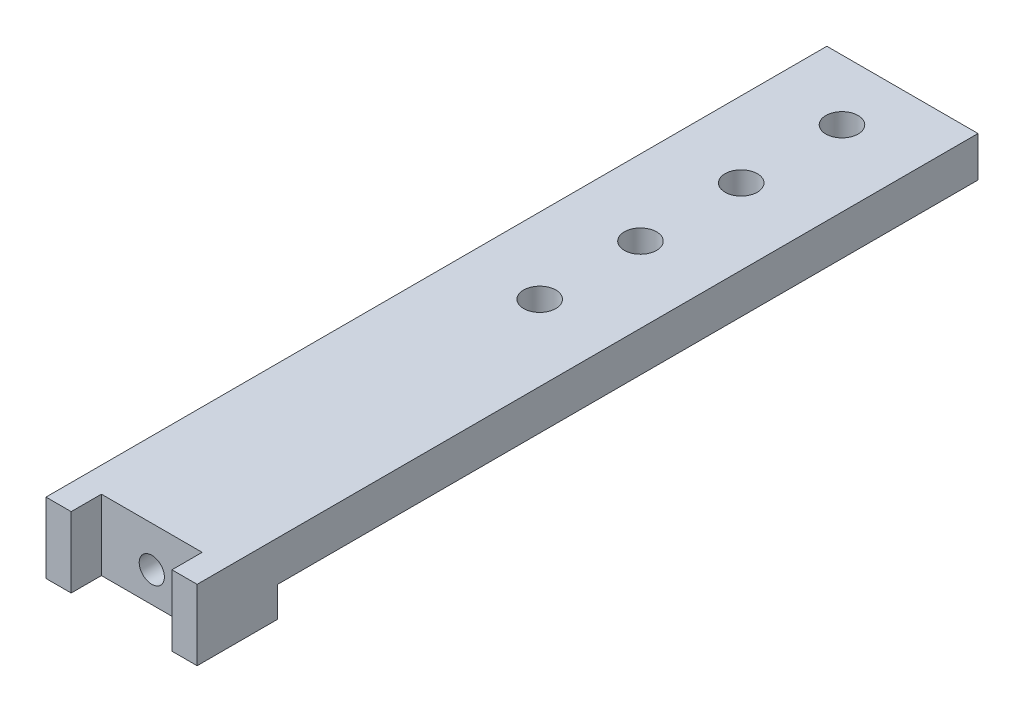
from build123d import *

# Parameters (mm, degrees)
SKETCH_1_W          = 15
SKETCH_1_H          = 74.5
EXTRUDE_1_DEPTH     = 4
SKETCH_2_W          = 10
SKETCH_2_H          = 40
EXTRUDE_2_DEPTH     = 1
SKETCH_3_W          = 15
SKETCH_3_H          = 5
EXTRUDE_3_DEPTH     = 3
SKETCH_4_W          = 2.5
SKETCH_4_H          = 7
EXTRUDE_4_DEPTH     = 3
SKETCH_5_R          = 1.6
CUT_EXTRUDE_1_DEPTH = 5
SKETCH_6_R          = 1.25
CUT_EXTRUDE_2_DEPTH = 5


with BuildPart() as part:
    # Sketch 1 → Extrude 1 (new body)
    with BuildSketch(Plane(origin=(0, 0, 0), x_dir=(1, 0, 0), z_dir=(0, 1, 0))):
        Rectangle(SKETCH_1_W, SKETCH_1_H)
    extrude(amount=EXTRUDE_1_DEPTH)

    # Sketch 2 → Extrude 2 (add)
    with BuildSketch(Plane(origin=(0, 0, 0), x_dir=(1, 0, 0), z_dir=(0, 1, 0))):
        with Locations((0, 17.25)):
            Rectangle(SKETCH_2_W, SKETCH_2_H)
    extrude(amount=-EXTRUDE_2_DEPTH)

    # Sketch 3 → Extrude 3 (add)
    with BuildSketch(Plane.XZ):
        with Locations((0, 34.75)):
            Rectangle(SKETCH_3_W, SKETCH_3_H)
    extrude(amount=EXTRUDE_3_DEPTH)

    # Sketch 4 → Extrude 4 (add)
    with BuildSketch(Plane.XY.offset(37.25)):
        with Locations((6.25, 0.5)):
            Rectangle(SKETCH_4_W, SKETCH_4_H)
        with Locations((-6.25, 0.5)):
            Rectangle(SKETCH_4_W, SKETCH_4_H)
    extrude(amount=EXTRUDE_4_DEPTH)

    # Sketch 5 → Cut-Extrude 1 (cut)
    with BuildSketch(Plane.XZ.offset(1)):
        with Locations(Location((0, -31.25, 0), (0, 0, 270))):
            Circle(SKETCH_5_R)
        with Locations(Location((0, -21.25, 0), (0, 0, 270))):
            Circle(SKETCH_5_R)
        with Locations(Location((0, -11.25, 0), (0, 0, 270))):
            Circle(SKETCH_5_R)
        with Locations(Location((0, -1.25, 0), (0, 0, 270))):
            Circle(SKETCH_5_R)
    extrude(amount=-CUT_EXTRUDE_1_DEPTH, mode=Mode.SUBTRACT)

    # Sketch 6 → Cut-Extrude 2 (cut)
    with BuildSketch(Plane.XY.offset(37.25)):
        Circle(SKETCH_6_R)
    extrude(amount=-CUT_EXTRUDE_2_DEPTH, mode=Mode.SUBTRACT)


solid = part.part
